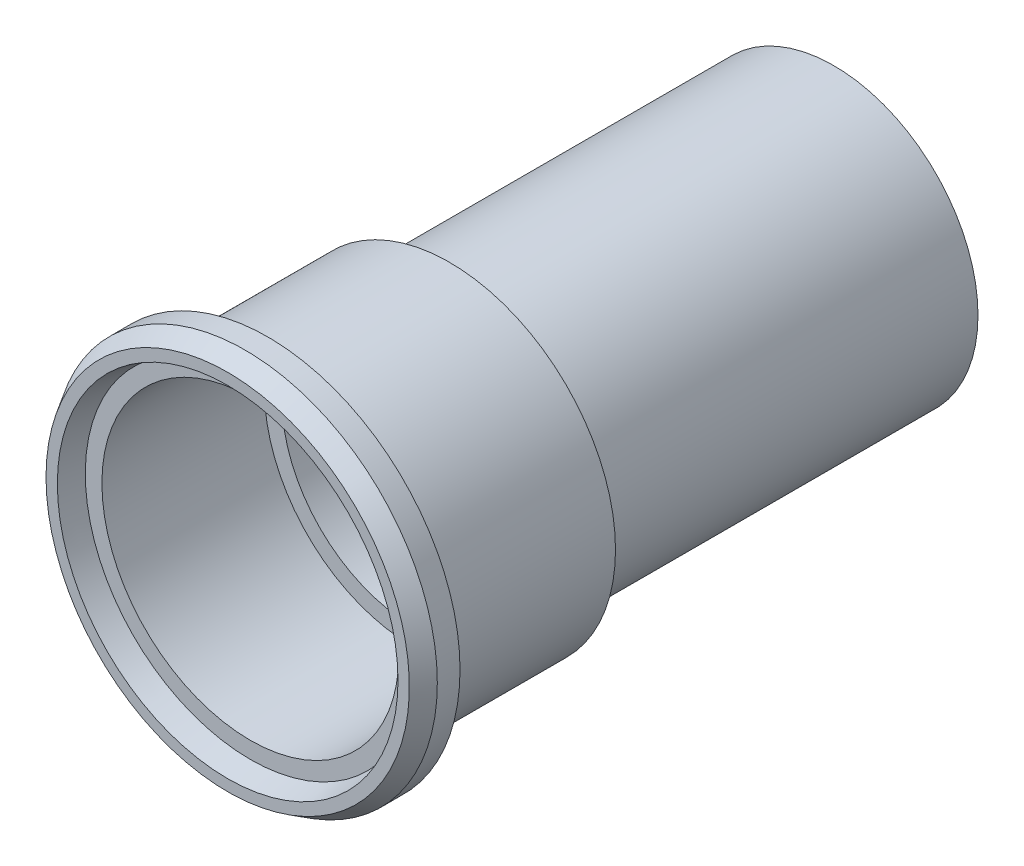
ISO-10303-21;
HEADER;
FILE_DESCRIPTION(('STEP AP214'),'2;1');
FILE_NAME('part.step','',(''),(''),'','','');
FILE_SCHEMA(('AUTOMOTIVE_DESIGN { 1 0 10303 214 1 1 1 1 }'));
ENDSEC;
DATA;
#1=APPLICATION_CONTEXT('core data for automotive mechanical design processes');
#2=APPLICATION_PROTOCOL_DEFINITION('international standard','automotive_design',2000,#1);
#3=PRODUCT_CONTEXT('',#1,'mechanical');
#4=PRODUCT('Part','Part','',(#3));
#5=PRODUCT_RELATED_PRODUCT_CATEGORY('part','',(#4));
#6=PRODUCT_DEFINITION_FORMATION('','',#4);
#7=PRODUCT_DEFINITION_CONTEXT('part definition',#1,'design');
#8=PRODUCT_DEFINITION('design','',#6,#7);
#9=PRODUCT_DEFINITION_SHAPE('','',#8);
#10=(LENGTH_UNIT() NAMED_UNIT(*) SI_UNIT(.MILLI.,.METRE.));
#11=(NAMED_UNIT(*) PLANE_ANGLE_UNIT() SI_UNIT($,.RADIAN.));
#12=(NAMED_UNIT(*) SI_UNIT($,.STERADIAN.) SOLID_ANGLE_UNIT());
#13=UNCERTAINTY_MEASURE_WITH_UNIT(LENGTH_MEASURE(1.E-05),#10,'distance_accuracy_value','');
#14=(GEOMETRIC_REPRESENTATION_CONTEXT(3) GLOBAL_UNCERTAINTY_ASSIGNED_CONTEXT((#13)) GLOBAL_UNIT_ASSIGNED_CONTEXT((#10,
#11,#12)) REPRESENTATION_CONTEXT('',''));
#15=CARTESIAN_POINT('',(0.,0.,0.));
#16=DIRECTION('',(0.,0.,1.));
#17=DIRECTION('',(1.,0.,0.));
#18=AXIS2_PLACEMENT_3D('',#15,#16,#17);
#19=CARTESIAN_POINT('',(0.,0.,33.4));
#20=DIRECTION('',(0.,0.,1.));
#21=DIRECTION('',(1.,0.,0.));
#22=AXIS2_PLACEMENT_3D('',#19,#20,#21);
#23=PLANE('',#22);
#24=CARTESIAN_POINT('',(0.,0.,33.4));
#25=DIRECTION('',(0.,0.,1.));
#26=DIRECTION('',(1.,0.,0.));
#27=AXIS2_PLACEMENT_3D('',#24,#25,#26);
#28=CIRCLE('',#27,8.5);
#29=CARTESIAN_POINT('',(8.5,0.,33.4));
#30=VERTEX_POINT('',#29);
#31=EDGE_CURVE('E59',#30,#30,#28,.F.);
#32=ORIENTED_EDGE('',*,*,#31,.T.);
#33=EDGE_LOOP('',(#32));
#34=FACE_BOUND('',#33,.T.);
#35=CARTESIAN_POINT('',(0.,0.,33.4));
#36=DIRECTION('',(0.,0.,1.));
#37=DIRECTION('',(0.,-1.,0.));
#38=AXIS2_PLACEMENT_3D('',#35,#36,#37);
#39=CIRCLE('',#38,9.45);
#40=CARTESIAN_POINT('',(0.,-9.45,33.4));
#41=VERTEX_POINT('',#40);
#42=EDGE_CURVE('E17',#41,#41,#39,.T.);
#43=ORIENTED_EDGE('',*,*,#42,.T.);
#44=EDGE_LOOP('',(#43));
#45=FACE_BOUND('',#44,.T.);
#46=ADVANCED_FACE('F14',(#34,#45),#23,.T.);
#47=CARTESIAN_POINT('',(0.,0.,34.7));
#48=DIRECTION('',(0.,0.,1.));
#49=DIRECTION('',(0.,-1.,0.));
#50=AXIS2_PLACEMENT_3D('',#47,#48,#49);
#51=CONICAL_SURFACE('',#50,9.75,0.226798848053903);
#52=ORIENTED_EDGE('',*,*,#42,.F.);
#53=EDGE_LOOP('',(#52));
#54=FACE_BOUND('',#53,.T.);
#55=CARTESIAN_POINT('',(0.,0.,34.7));
#56=DIRECTION('',(0.,0.,1.));
#57=DIRECTION('',(0.,-1.,0.));
#58=AXIS2_PLACEMENT_3D('',#55,#56,#57);
#59=CIRCLE('',#58,9.75);
#60=CARTESIAN_POINT('',(0.,-9.75,34.7));
#61=VERTEX_POINT('',#60);
#62=EDGE_CURVE('E57',#61,#61,#59,.F.);
#63=ORIENTED_EDGE('',*,*,#62,.F.);
#64=EDGE_LOOP('',(#63));
#65=FACE_BOUND('',#64,.T.);
#66=ADVANCED_FACE('F67',(#54,#65),#51,.F.);
#67=CARTESIAN_POINT('',(0.,0.,34.7));
#68=DIRECTION('',(0.,0.,1.));
#69=DIRECTION('',(1.,0.,0.));
#70=AXIS2_PLACEMENT_3D('',#67,#68,#69);
#71=CYLINDRICAL_SURFACE('',#70,8.5);
#72=CARTESIAN_POINT('',(0.,0.,24.1));
#73=DIRECTION('',(0.,0.,1.));
#74=DIRECTION('',(1.,0.,0.));
#75=AXIS2_PLACEMENT_3D('',#72,#73,#74);
#76=CIRCLE('',#75,8.5);
#77=CARTESIAN_POINT('',(8.5,0.,24.1));
#78=VERTEX_POINT('',#77);
#79=EDGE_CURVE('E54',#78,#78,#76,.T.);
#80=ORIENTED_EDGE('',*,*,#79,.F.);
#81=EDGE_LOOP('',(#80));
#82=FACE_BOUND('',#81,.T.);
#83=ORIENTED_EDGE('',*,*,#31,.F.);
#84=EDGE_LOOP('',(#83));
#85=FACE_BOUND('',#84,.T.);
#86=ADVANCED_FACE('F70',(#82,#85),#71,.F.);
#87=CARTESIAN_POINT('',(0.,0.,34.7));
#88=DIRECTION('',(0.,0.,1.));
#89=DIRECTION('',(1.,0.,0.));
#90=AXIS2_PLACEMENT_3D('',#87,#88,#89);
#91=PLANE('',#90);
#92=ORIENTED_EDGE('',*,*,#62,.T.);
#93=EDGE_LOOP('',(#92));
#94=FACE_BOUND('',#93,.T.);
#95=CARTESIAN_POINT('',(0.,0.,34.6999999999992));
#96=DIRECTION('',(0.,0.,-1.));
#97=DIRECTION('',(-1.,0.,0.));
#98=AXIS2_PLACEMENT_3D('',#95,#96,#97);
#99=CIRCLE('',#98,10.3999999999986);
#100=CARTESIAN_POINT('',(-10.3999999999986,0.,34.6999999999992));
#101=VERTEX_POINT('',#100);
#102=EDGE_CURVE('E51',#101,#101,#99,.T.);
#103=ORIENTED_EDGE('',*,*,#102,.F.);
#104=EDGE_LOOP('',(#103));
#105=FACE_BOUND('',#104,.T.);
#106=ADVANCED_FACE('F73',(#94,#105),#91,.T.);
#107=CARTESIAN_POINT('',(0.,0.,24.1));
#108=DIRECTION('',(0.,0.,1.));
#109=DIRECTION('',(1.,0.,0.));
#110=AXIS2_PLACEMENT_3D('',#107,#108,#109);
#111=PLANE('',#110);
#112=CARTESIAN_POINT('',(0.,0.,24.1));
#113=DIRECTION('',(0.,0.,1.));
#114=DIRECTION('',(1.,0.,0.));
#115=AXIS2_PLACEMENT_3D('',#112,#113,#114);
#116=CIRCLE('',#115,7.5);
#117=CARTESIAN_POINT('',(7.5,0.,24.1));
#118=VERTEX_POINT('',#117);
#119=EDGE_CURVE('E48',#118,#118,#116,.F.);
#120=ORIENTED_EDGE('',*,*,#119,.T.);
#121=EDGE_LOOP('',(#120));
#122=FACE_BOUND('',#121,.T.);
#123=ORIENTED_EDGE('',*,*,#79,.T.);
#124=EDGE_LOOP('',(#123));
#125=FACE_BOUND('',#124,.T.);
#126=ADVANCED_FACE('F76',(#122,#125),#111,.T.);
#127=CARTESIAN_POINT('',(0.,0.,33.6999999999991));
#128=DIRECTION('',(0.,0.,-1.));
#129=DIRECTION('',(-1.,0.,0.));
#130=AXIS2_PLACEMENT_3D('',#127,#128,#129);
#131=CONICAL_SURFACE('',#130,10.9999999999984,0.540419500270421);
#132=CARTESIAN_POINT('',(0.,0.,33.7));
#133=DIRECTION('',(0.,0.,1.));
#134=DIRECTION('',(1.,0.,0.));
#135=AXIS2_PLACEMENT_3D('',#132,#133,#134);
#136=CIRCLE('',#135,11.);
#137=CARTESIAN_POINT('',(11.,0.,33.7));
#138=VERTEX_POINT('',#137);
#139=EDGE_CURVE('E29',#138,#138,#136,.F.);
#140=ORIENTED_EDGE('',*,*,#139,.F.);
#141=EDGE_LOOP('',(#140));
#142=FACE_BOUND('',#141,.T.);
#143=ORIENTED_EDGE('',*,*,#102,.T.);
#144=EDGE_LOOP('',(#143));
#145=FACE_BOUND('',#144,.T.);
#146=ADVANCED_FACE('F80',(#142,#145),#131,.T.);
#147=CARTESIAN_POINT('',(0.,0.,38.17));
#148=DIRECTION('',(0.,0.,1.));
#149=DIRECTION('',(1.,0.,0.));
#150=AXIS2_PLACEMENT_3D('',#147,#148,#149);
#151=CYLINDRICAL_SURFACE('',#150,7.5);
#152=ORIENTED_EDGE('',*,*,#119,.F.);
#153=EDGE_LOOP('',(#152));
#154=FACE_BOUND('',#153,.T.);
#155=CARTESIAN_POINT('',(0.,0.,5.));
#156=DIRECTION('',(0.,0.,1.));
#157=DIRECTION('',(1.,0.,0.));
#158=AXIS2_PLACEMENT_3D('',#155,#156,#157);
#159=CIRCLE('',#158,7.5);
#160=CARTESIAN_POINT('',(7.5,0.,5.));
#161=VERTEX_POINT('',#160);
#162=EDGE_CURVE('E45',#161,#161,#159,.F.);
#163=ORIENTED_EDGE('',*,*,#162,.T.);
#164=EDGE_LOOP('',(#163));
#165=FACE_BOUND('',#164,.T.);
#166=ADVANCED_FACE('F82',(#154,#165),#151,.F.);
#167=CARTESIAN_POINT('',(0.,0.,34.7));
#168=DIRECTION('',(0.,0.,1.));
#169=DIRECTION('',(1.,0.,0.));
#170=AXIS2_PLACEMENT_3D('',#167,#168,#169);
#171=CYLINDRICAL_SURFACE('',#170,11.);
#172=ORIENTED_EDGE('',*,*,#139,.T.);
#173=EDGE_LOOP('',(#172));
#174=FACE_BOUND('',#173,.T.);
#175=CARTESIAN_POINT('',(0.,0.,32.4));
#176=DIRECTION('',(0.,0.,1.));
#177=DIRECTION('',(1.,0.,0.));
#178=AXIS2_PLACEMENT_3D('',#175,#176,#177);
#179=CIRCLE('',#178,11.);
#180=CARTESIAN_POINT('',(11.,0.,32.4));
#181=VERTEX_POINT('',#180);
#182=EDGE_CURVE('E42',#181,#181,#179,.F.);
#183=ORIENTED_EDGE('',*,*,#182,.F.);
#184=EDGE_LOOP('',(#183));
#185=FACE_BOUND('',#184,.T.);
#186=ADVANCED_FACE('F91',(#174,#185),#171,.T.);
#187=CARTESIAN_POINT('',(0.,0.,5.));
#188=DIRECTION('',(0.,0.,-1.));
#189=DIRECTION('',(-1.,0.,0.));
#190=AXIS2_PLACEMENT_3D('',#187,#188,#189);
#191=PLANE('',#190);
#192=CARTESIAN_POINT('',(0.,0.,5.));
#193=DIRECTION('',(0.,0.,-1.));
#194=DIRECTION('',(-1.,0.,0.));
#195=AXIS2_PLACEMENT_3D('',#192,#193,#194);
#196=CIRCLE('',#195,6.925);
#197=CARTESIAN_POINT('',(-6.925,0.,5.));
#198=VERTEX_POINT('',#197);
#199=EDGE_CURVE('E39',#198,#198,#196,.T.);
#200=ORIENTED_EDGE('',*,*,#199,.T.);
#201=EDGE_LOOP('',(#200));
#202=FACE_BOUND('',#201,.T.);
#203=ORIENTED_EDGE('',*,*,#162,.F.);
#204=EDGE_LOOP('',(#203));
#205=FACE_BOUND('',#204,.T.);
#206=ADVANCED_FACE('F124',(#202,#205),#191,.F.);
#207=CARTESIAN_POINT('',(0.,0.,32.4));
#208=DIRECTION('',(0.,0.,-1.));
#209=DIRECTION('',(-1.,0.,0.));
#210=AXIS2_PLACEMENT_3D('',#207,#208,#209);
#211=PLANE('',#210);
#212=CARTESIAN_POINT('',(0.,0.,32.4));
#213=DIRECTION('',(0.,0.,1.));
#214=DIRECTION('',(1.,0.,0.));
#215=AXIS2_PLACEMENT_3D('',#212,#213,#214);
#216=CIRCLE('',#215,9.5);
#217=CARTESIAN_POINT('',(9.5,0.,32.4));
#218=VERTEX_POINT('',#217);
#219=EDGE_CURVE('E36',#218,#218,#216,.F.);
#220=ORIENTED_EDGE('',*,*,#219,.F.);
#221=EDGE_LOOP('',(#220));
#222=FACE_BOUND('',#221,.T.);
#223=ORIENTED_EDGE('',*,*,#182,.T.);
#224=EDGE_LOOP('',(#223));
#225=FACE_BOUND('',#224,.T.);
#226=ADVANCED_FACE('F120',(#222,#225),#211,.T.);
#227=CARTESIAN_POINT('',(0.,0.,0.));
#228=DIRECTION('',(0.,0.,-1.));
#229=DIRECTION('',(-1.,0.,0.));
#230=AXIS2_PLACEMENT_3D('',#227,#228,#229);
#231=CYLINDRICAL_SURFACE('',#230,6.925);
#232=ORIENTED_EDGE('',*,*,#199,.F.);
#233=EDGE_LOOP('',(#232));
#234=FACE_BOUND('',#233,.T.);
#235=CARTESIAN_POINT('',(0.,0.,0.));
#236=DIRECTION('',(0.,0.,-1.));
#237=DIRECTION('',(-1.,0.,0.));
#238=AXIS2_PLACEMENT_3D('',#235,#236,#237);
#239=CIRCLE('',#238,6.925);
#240=CARTESIAN_POINT('',(-6.925,0.,0.));
#241=VERTEX_POINT('',#240);
#242=EDGE_CURVE('E33',#241,#241,#239,.T.);
#243=ORIENTED_EDGE('',*,*,#242,.T.);
#244=EDGE_LOOP('',(#243));
#245=FACE_BOUND('',#244,.T.);
#246=ADVANCED_FACE('F116',(#234,#245),#231,.F.);
#247=CARTESIAN_POINT('',(0.,0.,22.));
#248=DIRECTION('',(0.,0.,1.));
#249=DIRECTION('',(1.,0.,0.));
#250=AXIS2_PLACEMENT_3D('',#247,#248,#249);
#251=CYLINDRICAL_SURFACE('',#250,9.5);
#252=ORIENTED_EDGE('',*,*,#219,.T.);
#253=EDGE_LOOP('',(#252));
#254=FACE_BOUND('',#253,.T.);
#255=CARTESIAN_POINT('',(0.,0.,22.));
#256=DIRECTION('',(0.,0.,1.));
#257=DIRECTION('',(1.,0.,0.));
#258=AXIS2_PLACEMENT_3D('',#255,#256,#257);
#259=CIRCLE('',#258,9.5);
#260=CARTESIAN_POINT('',(9.5,0.,22.));
#261=VERTEX_POINT('',#260);
#262=EDGE_CURVE('E26',#261,#261,#259,.T.);
#263=ORIENTED_EDGE('',*,*,#262,.T.);
#264=EDGE_LOOP('',(#263));
#265=FACE_BOUND('',#264,.T.);
#266=ADVANCED_FACE('F112',(#254,#265),#251,.T.);
#267=CARTESIAN_POINT('',(0.,0.,0.));
#268=DIRECTION('',(0.,0.,1.));
#269=DIRECTION('',(1.,0.,0.));
#270=AXIS2_PLACEMENT_3D('',#267,#268,#269);
#271=PLANE('',#270);
#272=ORIENTED_EDGE('',*,*,#242,.F.);
#273=EDGE_LOOP('',(#272));
#274=FACE_BOUND('',#273,.T.);
#275=CARTESIAN_POINT('',(0.,0.,0.));
#276=DIRECTION('',(0.,0.,1.));
#277=DIRECTION('',(1.,0.,0.));
#278=AXIS2_PLACEMENT_3D('',#275,#276,#277);
#279=CIRCLE('',#278,8.25);
#280=CARTESIAN_POINT('',(8.25,0.,0.));
#281=VERTEX_POINT('',#280);
#282=EDGE_CURVE('E21',#281,#281,#279,.T.);
#283=ORIENTED_EDGE('',*,*,#282,.F.);
#284=EDGE_LOOP('',(#283));
#285=FACE_BOUND('',#284,.T.);
#286=ADVANCED_FACE('F106',(#274,#285),#271,.F.);
#287=CARTESIAN_POINT('',(0.,0.,22.));
#288=DIRECTION('',(0.,0.,1.));
#289=DIRECTION('',(1.,0.,0.));
#290=AXIS2_PLACEMENT_3D('',#287,#288,#289);
#291=PLANE('',#290);
#292=CARTESIAN_POINT('',(0.,0.,22.));
#293=DIRECTION('',(0.,0.,1.));
#294=DIRECTION('',(1.,0.,0.));
#295=AXIS2_PLACEMENT_3D('',#292,#293,#294);
#296=CIRCLE('',#295,8.25);
#297=CARTESIAN_POINT('',(8.25,0.,22.));
#298=VERTEX_POINT('',#297);
#299=EDGE_CURVE('E10',#298,#298,#296,.F.);
#300=ORIENTED_EDGE('',*,*,#299,.F.);
#301=EDGE_LOOP('',(#300));
#302=FACE_BOUND('',#301,.T.);
#303=ORIENTED_EDGE('',*,*,#262,.F.);
#304=EDGE_LOOP('',(#303));
#305=FACE_BOUND('',#304,.T.);
#306=ADVANCED_FACE('F99',(#302,#305),#291,.F.);
#307=CARTESIAN_POINT('',(0.,0.,0.));
#308=DIRECTION('',(0.,0.,1.));
#309=DIRECTION('',(1.,0.,0.));
#310=AXIS2_PLACEMENT_3D('',#307,#308,#309);
#311=CYLINDRICAL_SURFACE('',#310,8.25);
#312=ORIENTED_EDGE('',*,*,#282,.T.);
#313=EDGE_LOOP('',(#312));
#314=FACE_BOUND('',#313,.T.);
#315=ORIENTED_EDGE('',*,*,#299,.T.);
#316=EDGE_LOOP('',(#315));
#317=FACE_BOUND('',#316,.T.);
#318=ADVANCED_FACE('F97',(#314,#317),#311,.T.);
#319=CLOSED_SHELL('',(#46,#66,#86,#106,#126,#146,#166,#186,#206,#226,#246,#266,#286,#306,#318));
#320=MANIFOLD_SOLID_BREP('B1',#319);
#321=ADVANCED_BREP_SHAPE_REPRESENTATION('',(#18,#320),#14);
#322=SHAPE_DEFINITION_REPRESENTATION(#9,#321);
ENDSEC;
END-ISO-10303-21;
